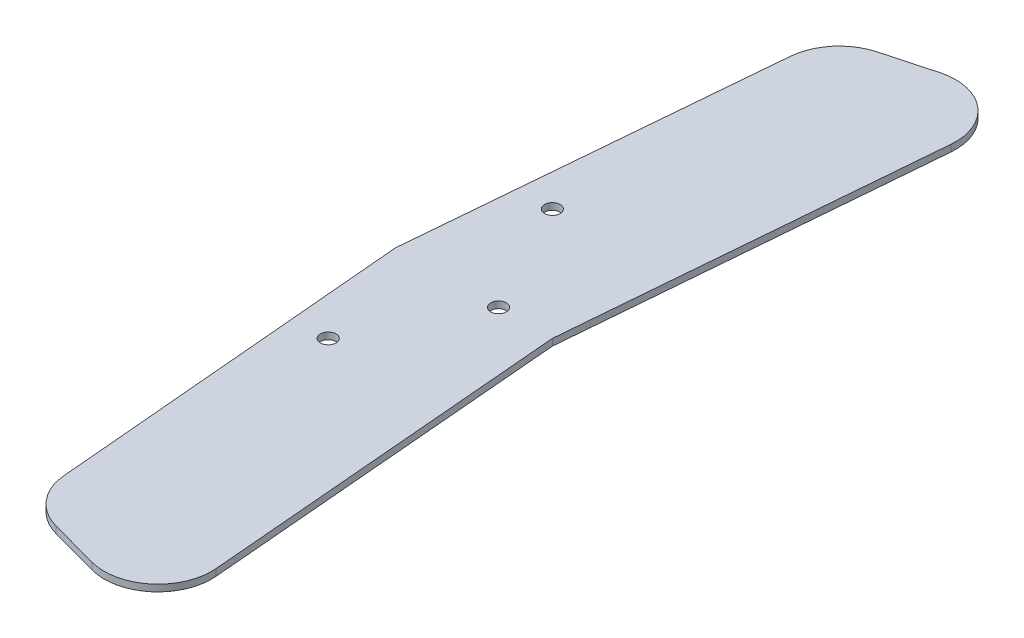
from build123d import *

# Parameters (mm, degrees)
SKETCH1_R      = 1.75
EXTRUDE1_DEPTH = 1.5


with BuildPart() as part:
    # Sketch1 → Extrude1 (new body)
    with BuildSketch(Plane(origin=(0, 0, 0), x_dir=(1, 0, 0), z_dir=(0, 1, 0))):
        with BuildLine():
            Line((35, 0), (41.957027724, 81.985363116))
            ThreePointArc((41.957027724, 81.985363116), (37.680930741, 92.219723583), (26.84259113, 94.577165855))
            Line((26.84259113, 94.577165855), (15.84259113, 91.577165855))
            ThreePointArc((15.84259113, 91.577165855), (9.788200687, 87.69043259), (7.045089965, 81.039291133))
            Line((7.045089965, 81.039291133), (0, 0))
            Line((0, 0), (7.045089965, -81.039291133))
            ThreePointArc((7.045089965, -81.039291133), (9.788200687, -87.69043259), (15.84259113, -91.577165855))
            Line((15.84259113, -91.577165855), (26.84259113, -94.577165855))
            ThreePointArc((26.84259113, -94.577165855), (37.680930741, -92.219723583), (41.957027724, -81.985363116))
            Line((41.957027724, -81.985363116), (35, 0))
        make_face()
        with Locations(Location((23, 0, 0), (0, 0, 270))):
            Circle(SKETCH1_R, mode=Mode.SUBTRACT)
        with Locations(Location((10, 25, 0), (0, 0, 270))):
            Circle(SKETCH1_R, mode=Mode.SUBTRACT)
        with Locations(Location((10, -25, 0), (0, 0, 90))):
            Circle(SKETCH1_R, mode=Mode.SUBTRACT)
    extrude(amount=EXTRUDE1_DEPTH)


solid = part.part
